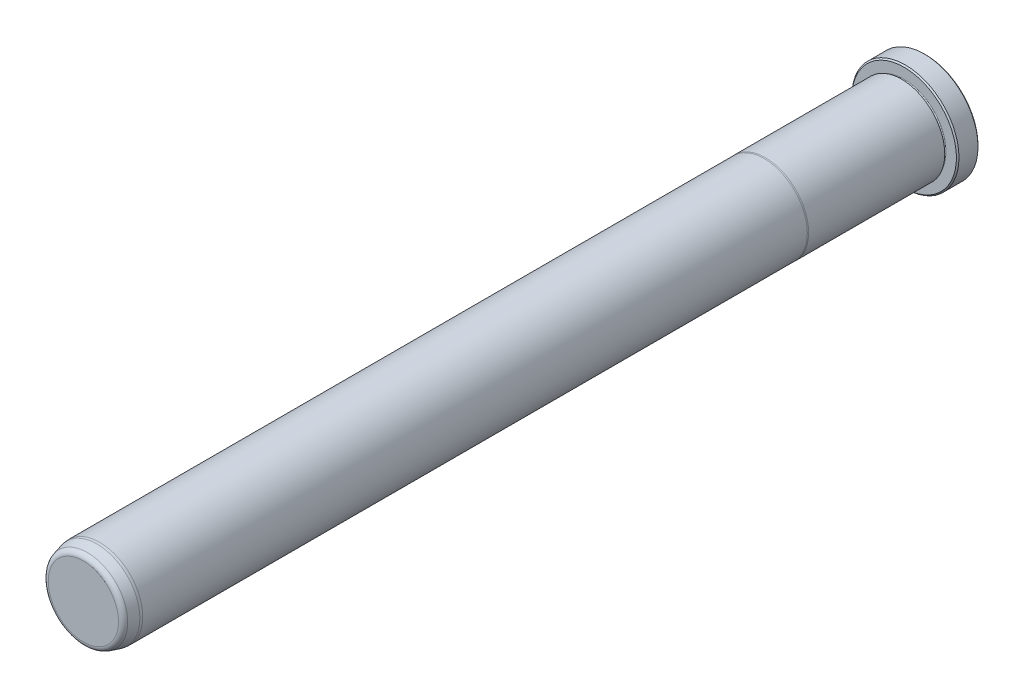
ISO-10303-21;
HEADER;
FILE_DESCRIPTION(('STEP AP214'),'2;1');
FILE_NAME('part.step','',(''),(''),'','','');
FILE_SCHEMA(('AUTOMOTIVE_DESIGN { 1 0 10303 214 1 1 1 1 }'));
ENDSEC;
DATA;
#1=APPLICATION_CONTEXT('core data for automotive mechanical design processes');
#2=APPLICATION_PROTOCOL_DEFINITION('international standard','automotive_design',2000,#1);
#3=PRODUCT_CONTEXT('',#1,'mechanical');
#4=PRODUCT('Part','Part','',(#3));
#5=PRODUCT_RELATED_PRODUCT_CATEGORY('part','',(#4));
#6=PRODUCT_DEFINITION_FORMATION('','',#4);
#7=PRODUCT_DEFINITION_CONTEXT('part definition',#1,'design');
#8=PRODUCT_DEFINITION('design','',#6,#7);
#9=PRODUCT_DEFINITION_SHAPE('','',#8);
#10=(LENGTH_UNIT() NAMED_UNIT(*) SI_UNIT(.MILLI.,.METRE.));
#11=(NAMED_UNIT(*) PLANE_ANGLE_UNIT() SI_UNIT($,.RADIAN.));
#12=(NAMED_UNIT(*) SI_UNIT($,.STERADIAN.) SOLID_ANGLE_UNIT());
#13=UNCERTAINTY_MEASURE_WITH_UNIT(LENGTH_MEASURE(1.E-05),#10,'distance_accuracy_value','');
#14=(GEOMETRIC_REPRESENTATION_CONTEXT(3) GLOBAL_UNCERTAINTY_ASSIGNED_CONTEXT((#13)) GLOBAL_UNIT_ASSIGNED_CONTEXT((#10,
#11,#12)) REPRESENTATION_CONTEXT('',''));
#15=CARTESIAN_POINT('',(0.,0.,0.));
#16=DIRECTION('',(0.,0.,1.));
#17=DIRECTION('',(1.,0.,0.));
#18=AXIS2_PLACEMENT_3D('',#15,#16,#17);
#19=CARTESIAN_POINT('',(0.,0.,0.));
#20=DIRECTION('',(0.,0.,1.));
#21=DIRECTION('',(1.,0.,0.));
#22=AXIS2_PLACEMENT_3D('',#19,#20,#21);
#23=PLANE('',#22);
#24=CARTESIAN_POINT('',(0.,0.,0.));
#25=DIRECTION('',(0.,0.,1.));
#26=DIRECTION('',(1.,0.,0.));
#27=AXIS2_PLACEMENT_3D('',#24,#25,#26);
#28=CIRCLE('',#27,15.367);
#29=CARTESIAN_POINT('',(15.367,0.,0.));
#30=VERTEX_POINT('',#29);
#31=EDGE_CURVE('E37',#30,#30,#28,.F.);
#32=ORIENTED_EDGE('',*,*,#31,.T.);
#33=EDGE_LOOP('',(#32));
#34=FACE_BOUND('',#33,.T.);
#35=ADVANCED_FACE('F30',(#34),#23,.F.);
#36=CARTESIAN_POINT('',(0.,0.,0.));
#37=DIRECTION('',(0.,0.,1.));
#38=DIRECTION('',(1.,0.,0.));
#39=AXIS2_PLACEMENT_3D('',#36,#37,#38);
#40=CYLINDRICAL_SURFACE('',#39,15.748);
#41=CARTESIAN_POINT('',(0.,0.,0.381000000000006));
#42=DIRECTION('',(0.,0.,1.));
#43=DIRECTION('',(1.,0.,0.));
#44=AXIS2_PLACEMENT_3D('',#41,#42,#43);
#45=CIRCLE('',#44,15.748);
#46=CARTESIAN_POINT('',(15.748,0.,0.381000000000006));
#47=VERTEX_POINT('',#46);
#48=EDGE_CURVE('E41',#47,#47,#45,.T.);
#49=ORIENTED_EDGE('',*,*,#48,.T.);
#50=EDGE_LOOP('',(#49));
#51=FACE_BOUND('',#50,.T.);
#52=CARTESIAN_POINT('',(0.,0.,5.96900000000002));
#53=DIRECTION('',(0.,0.,-1.));
#54=DIRECTION('',(-1.,0.,0.));
#55=AXIS2_PLACEMENT_3D('',#52,#53,#54);
#56=CIRCLE('',#55,15.748);
#57=CARTESIAN_POINT('',(-15.748,0.,5.96900000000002));
#58=VERTEX_POINT('',#57);
#59=EDGE_CURVE('E45',#58,#58,#56,.T.);
#60=ORIENTED_EDGE('',*,*,#59,.T.);
#61=EDGE_LOOP('',(#60));
#62=FACE_BOUND('',#61,.T.);
#63=ADVANCED_FACE('F118',(#51,#62),#40,.T.);
#64=CARTESIAN_POINT('',(0.,15.748,6.35));
#65=DIRECTION('',(0.,0.,-1.));
#66=DIRECTION('',(-1.,0.,0.));
#67=AXIS2_PLACEMENT_3D('',#64,#65,#66);
#68=PLANE('',#67);
#69=CARTESIAN_POINT('',(0.,0.,6.35));
#70=DIRECTION('',(0.,0.,-1.));
#71=DIRECTION('',(-1.,0.,0.));
#72=AXIS2_PLACEMENT_3D('',#69,#70,#71);
#73=CIRCLE('',#72,15.367);
#74=CARTESIAN_POINT('',(-15.367,0.,6.35));
#75=VERTEX_POINT('',#74);
#76=EDGE_CURVE('E10',#75,#75,#73,.F.);
#77=ORIENTED_EDGE('',*,*,#76,.T.);
#78=EDGE_LOOP('',(#77));
#79=FACE_BOUND('',#78,.T.);
#80=CARTESIAN_POINT('',(0.,0.,6.35));
#81=DIRECTION('',(0.,0.,1.));
#82=DIRECTION('',(1.,0.,0.));
#83=AXIS2_PLACEMENT_3D('',#80,#81,#82);
#84=CIRCLE('',#83,12.3063);
#85=CARTESIAN_POINT('',(12.3063,0.,6.35));
#86=VERTEX_POINT('',#85);
#87=EDGE_CURVE('E56',#86,#86,#84,.T.);
#88=ORIENTED_EDGE('',*,*,#87,.F.);
#89=EDGE_LOOP('',(#88));
#90=FACE_BOUND('',#89,.T.);
#91=ADVANCED_FACE('F113',(#79,#90),#68,.F.);
#92=CARTESIAN_POINT('',(0.,0.,6.731));
#93=DIRECTION('',(0.,0.,1.));
#94=DIRECTION('',(1.,0.,0.));
#95=AXIS2_PLACEMENT_3D('',#92,#93,#94);
#96=TOROIDAL_SURFACE('',#95,12.3063,0.381);
#97=CARTESIAN_POINT('',(0.,0.,7.112));
#98=DIRECTION('',(0.,0.,1.));
#99=DIRECTION('',(1.,0.,0.));
#100=AXIS2_PLACEMENT_3D('',#97,#98,#99);
#101=CIRCLE('',#100,12.3063);
#102=CARTESIAN_POINT('',(12.3063,0.,7.112));
#103=VERTEX_POINT('',#102);
#104=EDGE_CURVE('E59',#103,#103,#101,.T.);
#105=ORIENTED_EDGE('',*,*,#104,.F.);
#106=EDGE_LOOP('',(#105));
#107=FACE_BOUND('',#106,.T.);
#108=ORIENTED_EDGE('',*,*,#87,.T.);
#109=EDGE_LOOP('',(#108));
#110=FACE_BOUND('',#109,.T.);
#111=ADVANCED_FACE('F107',(#107,#110),#96,.F.);
#112=CARTESIAN_POINT('',(0.,12.3063,7.112));
#113=DIRECTION('',(0.,0.,1.));
#114=DIRECTION('',(1.,0.,0.));
#115=AXIS2_PLACEMENT_3D('',#112,#113,#114);
#116=PLANE('',#115);
#117=CARTESIAN_POINT('',(0.,0.,7.112));
#118=DIRECTION('',(0.,0.,1.));
#119=DIRECTION('',(1.,0.,0.));
#120=AXIS2_PLACEMENT_3D('',#117,#118,#119);
#121=CIRCLE('',#120,12.7127);
#122=CARTESIAN_POINT('',(12.7127,0.,7.112));
#123=VERTEX_POINT('',#122);
#124=EDGE_CURVE('E62',#123,#123,#121,.T.);
#125=ORIENTED_EDGE('',*,*,#124,.F.);
#126=EDGE_LOOP('',(#125));
#127=FACE_BOUND('',#126,.T.);
#128=ORIENTED_EDGE('',*,*,#104,.T.);
#129=EDGE_LOOP('',(#128));
#130=FACE_BOUND('',#129,.T.);
#131=ADVANCED_FACE('F101',(#127,#130),#116,.F.);
#132=CARTESIAN_POINT('',(0.,0.,0.));
#133=DIRECTION('',(0.,0.,1.));
#134=DIRECTION('',(1.,0.,0.));
#135=AXIS2_PLACEMENT_3D('',#132,#133,#134);
#136=CYLINDRICAL_SURFACE('',#135,12.7127);
#137=CARTESIAN_POINT('',(0.,0.,47.1347630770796));
#138=DIRECTION('',(0.,0.,1.));
#139=DIRECTION('',(1.,0.,0.));
#140=AXIS2_PLACEMENT_3D('',#137,#138,#139);
#141=CIRCLE('',#140,12.7127);
#142=CARTESIAN_POINT('',(12.7127,0.,47.1347630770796));
#143=VERTEX_POINT('',#142);
#144=EDGE_CURVE('E65',#143,#143,#141,.T.);
#145=ORIENTED_EDGE('',*,*,#144,.F.);
#146=EDGE_LOOP('',(#145));
#147=FACE_BOUND('',#146,.T.);
#148=ORIENTED_EDGE('',*,*,#124,.T.);
#149=EDGE_LOOP('',(#148));
#150=FACE_BOUND('',#149,.T.);
#151=ADVANCED_FACE('F95',(#147,#150),#136,.T.);
#152=CARTESIAN_POINT('',(0.,0.,47.1347630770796));
#153=DIRECTION('',(0.,0.,-1.));
#154=DIRECTION('',(-1.,0.,0.));
#155=AXIS2_PLACEMENT_3D('',#152,#153,#154);
#156=CONICAL_SURFACE('',#155,12.7127,0.0698131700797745);
#157=CARTESIAN_POINT('',(0.,0.,47.498));
#158=DIRECTION('',(0.,0.,1.));
#159=DIRECTION('',(1.,0.,0.));
#160=AXIS2_PLACEMENT_3D('',#157,#158,#159);
#161=CIRCLE('',#160,12.6873);
#162=CARTESIAN_POINT('',(12.6873,0.,47.498));
#163=VERTEX_POINT('',#162);
#164=EDGE_CURVE('E68',#163,#163,#161,.T.);
#165=ORIENTED_EDGE('',*,*,#164,.F.);
#166=EDGE_LOOP('',(#165));
#167=FACE_BOUND('',#166,.T.);
#168=ORIENTED_EDGE('',*,*,#144,.T.);
#169=EDGE_LOOP('',(#168));
#170=FACE_BOUND('',#169,.T.);
#171=ADVANCED_FACE('F89',(#167,#170),#156,.T.);
#172=CARTESIAN_POINT('',(0.,0.,0.));
#173=DIRECTION('',(0.,0.,1.));
#174=DIRECTION('',(1.,0.,0.));
#175=AXIS2_PLACEMENT_3D('',#172,#173,#174);
#176=CYLINDRICAL_SURFACE('',#175,12.6873);
#177=CARTESIAN_POINT('',(0.,0.,242.8875));
#178=DIRECTION('',(0.,0.,1.));
#179=DIRECTION('',(1.,0.,0.));
#180=AXIS2_PLACEMENT_3D('',#177,#178,#179);
#181=CIRCLE('',#180,12.6873);
#182=CARTESIAN_POINT('',(12.6873,0.,242.8875));
#183=VERTEX_POINT('',#182);
#184=EDGE_CURVE('E71',#183,#183,#181,.T.);
#185=ORIENTED_EDGE('',*,*,#184,.F.);
#186=EDGE_LOOP('',(#185));
#187=FACE_BOUND('',#186,.T.);
#188=ORIENTED_EDGE('',*,*,#164,.T.);
#189=EDGE_LOOP('',(#188));
#190=FACE_BOUND('',#189,.T.);
#191=ADVANCED_FACE('F83',(#187,#190),#176,.T.);
#192=CARTESIAN_POINT('',(0.,0.,242.8875));
#193=DIRECTION('',(0.,0.,-1.));
#194=DIRECTION('',(-1.,0.,0.));
#195=AXIS2_PLACEMENT_3D('',#192,#193,#194);
#196=CONICAL_SURFACE('',#195,12.6873,0.0872664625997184);
#197=CARTESIAN_POINT('',(0.,0.,243.6495));
#198=DIRECTION('',(0.,0.,1.));
#199=DIRECTION('',(1.,0.,0.));
#200=AXIS2_PLACEMENT_3D('',#197,#198,#199);
#201=CIRCLE('',#200,12.6206336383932);
#202=CARTESIAN_POINT('',(12.6206336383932,0.,243.6495));
#203=VERTEX_POINT('',#202);
#204=EDGE_CURVE('E74',#203,#203,#201,.T.);
#205=ORIENTED_EDGE('',*,*,#204,.F.);
#206=EDGE_LOOP('',(#205));
#207=FACE_BOUND('',#206,.T.);
#208=ORIENTED_EDGE('',*,*,#184,.T.);
#209=EDGE_LOOP('',(#208));
#210=FACE_BOUND('',#209,.T.);
#211=ADVANCED_FACE('F80',(#207,#210),#196,.T.);
#212=CARTESIAN_POINT('',(0.,0.,243.6495));
#213=DIRECTION('',(0.,0.,-1.));
#214=DIRECTION('',(-1.,0.,0.));
#215=AXIS2_PLACEMENT_3D('',#212,#213,#214);
#216=CONICAL_SURFACE('',#215,12.6206336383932,0.26179938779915);
#217=CARTESIAN_POINT('',(0.,0.,246.4733752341));
#218=DIRECTION('',(0.,0.,1.));
#219=DIRECTION('',(1.,0.,0.));
#220=AXIS2_PLACEMENT_3D('',#217,#218,#219);
#221=CIRCLE('',#220,11.8639785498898);
#222=CARTESIAN_POINT('',(11.8639785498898,0.,246.4733752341));
#223=VERTEX_POINT('',#222);
#224=EDGE_CURVE('E50',#223,#223,#221,.F.);
#225=ORIENTED_EDGE('',*,*,#224,.T.);
#226=EDGE_LOOP('',(#225));
#227=FACE_BOUND('',#226,.T.);
#228=ORIENTED_EDGE('',*,*,#204,.T.);
#229=EDGE_LOOP('',(#228));
#230=FACE_BOUND('',#229,.T.);
#231=ADVANCED_FACE('F78',(#227,#230),#216,.T.);
#232=CARTESIAN_POINT('',(0.,11.5487028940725,247.65));
#233=DIRECTION('',(0.,0.,-1.));
#234=DIRECTION('',(-1.,0.,0.));
#235=AXIS2_PLACEMENT_3D('',#232,#233,#234);
#236=PLANE('',#235);
#237=CARTESIAN_POINT('',(0.,0.,247.65));
#238=DIRECTION('',(0.,0.,-1.));
#239=DIRECTION('',(-1.,0.,0.));
#240=AXIS2_PLACEMENT_3D('',#237,#238,#239);
#241=CIRCLE('',#240,10.3305713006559);
#242=CARTESIAN_POINT('',(-10.3305713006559,0.,247.65));
#243=VERTEX_POINT('',#242);
#244=EDGE_CURVE('E53',#243,#243,#241,.F.);
#245=ORIENTED_EDGE('',*,*,#244,.T.);
#246=EDGE_LOOP('',(#245));
#247=FACE_BOUND('',#246,.T.);
#248=ADVANCED_FACE('F133',(#247),#236,.F.);
#249=CARTESIAN_POINT('',(0.,0.,246.0625));
#250=DIRECTION('',(0.,0.,-1.));
#251=DIRECTION('',(-1.,0.,0.));
#252=AXIS2_PLACEMENT_3D('',#249,#250,#251);
#253=TOROIDAL_SURFACE('',#252,10.3305713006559,1.5875);
#254=ORIENTED_EDGE('',*,*,#224,.F.);
#255=EDGE_LOOP('',(#254));
#256=FACE_BOUND('',#255,.T.);
#257=ORIENTED_EDGE('',*,*,#244,.F.);
#258=EDGE_LOOP('',(#257));
#259=FACE_BOUND('',#258,.T.);
#260=ADVANCED_FACE('F130',(#256,#259),#253,.T.);
#261=CARTESIAN_POINT('',(0.,0.,0.381000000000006));
#262=DIRECTION('',(0.,0.,1.));
#263=DIRECTION('',(1.,0.,0.));
#264=AXIS2_PLACEMENT_3D('',#261,#262,#263);
#265=CONICAL_SURFACE('',#264,15.748,0.785398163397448);
#266=CARTESIAN_POINT('',(15.367,0.,0.));
#267=CARTESIAN_POINT('',(15.37096875,0.,0.00396874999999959));
#268=CARTESIAN_POINT('',(15.3749375,0.,0.00793749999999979));
#269=CARTESIAN_POINT('',(15.382875,0.,0.0158750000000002));
#270=CARTESIAN_POINT('',(15.38684375,0.,0.0198437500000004));
#271=CARTESIAN_POINT('',(15.39478125,0.,0.0277812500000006));
#272=CARTESIAN_POINT('',(15.39875,0.,0.0317500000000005));
#273=CARTESIAN_POINT('',(15.4066875,0.,0.0396875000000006));
#274=CARTESIAN_POINT('',(15.41065625,0.,0.0436562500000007));
#275=CARTESIAN_POINT('',(15.41859375,0.,0.0515937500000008));
#276=CARTESIAN_POINT('',(15.4225625,0.,0.0555625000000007));
#277=CARTESIAN_POINT('',(15.4305,0.,0.0635000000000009));
#278=CARTESIAN_POINT('',(15.43446875,0.,0.0674687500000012));
#279=CARTESIAN_POINT('',(15.44240625,0.,0.0754062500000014));
#280=CARTESIAN_POINT('',(15.446375,0.,0.0793750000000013));
#281=CARTESIAN_POINT('',(15.4543125,0.,0.0873125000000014));
#282=CARTESIAN_POINT('',(15.45828125,0.,0.0912812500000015));
#283=CARTESIAN_POINT('',(15.46621875,0.,0.0992187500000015));
#284=CARTESIAN_POINT('',(15.4701875,0.,0.103187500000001));
#285=CARTESIAN_POINT('',(15.478125,0.,0.111125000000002));
#286=CARTESIAN_POINT('',(15.48209375,0.,0.115093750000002));
#287=CARTESIAN_POINT('',(15.49003125,0.,0.123031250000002));
#288=CARTESIAN_POINT('',(15.494,0.,0.127000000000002));
#289=CARTESIAN_POINT('',(15.5019375,0.,0.134937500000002));
#290=CARTESIAN_POINT('',(15.50590625,0.,0.138906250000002));
#291=CARTESIAN_POINT('',(15.51384375,0.,0.146843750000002));
#292=CARTESIAN_POINT('',(15.5178125,0.,0.150812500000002));
#293=CARTESIAN_POINT('',(15.52575,0.,0.158750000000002));
#294=CARTESIAN_POINT('',(15.52971875,0.,0.162718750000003));
#295=CARTESIAN_POINT('',(15.53765625,0.,0.170656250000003));
#296=CARTESIAN_POINT('',(15.541625,0.,0.174625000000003));
#297=CARTESIAN_POINT('',(15.5495625,0.,0.182562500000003));
#298=CARTESIAN_POINT('',(15.55353125,0.,0.186531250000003));
#299=CARTESIAN_POINT('',(15.56146875,0.,0.194468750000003));
#300=CARTESIAN_POINT('',(15.5654375,0.,0.198437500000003));
#301=CARTESIAN_POINT('',(15.573375,0.,0.206375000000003));
#302=CARTESIAN_POINT('',(15.57734375,0.,0.210343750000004));
#303=CARTESIAN_POINT('',(15.58528125,0.,0.218281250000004));
#304=CARTESIAN_POINT('',(15.58925,0.,0.222250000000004));
#305=CARTESIAN_POINT('',(15.5971875,0.,0.230187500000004));
#306=CARTESIAN_POINT('',(15.60115625,0.,0.234156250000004));
#307=CARTESIAN_POINT('',(15.60909375,0.,0.242093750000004));
#308=CARTESIAN_POINT('',(15.6130625,0.,0.246062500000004));
#309=CARTESIAN_POINT('',(15.621,0.,0.254000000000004));
#310=CARTESIAN_POINT('',(15.62496875,0.,0.257968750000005));
#311=CARTESIAN_POINT('',(15.63290625,0.,0.265906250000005));
#312=CARTESIAN_POINT('',(15.636875,0.,0.269875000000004));
#313=CARTESIAN_POINT('',(15.6448125,0.,0.277812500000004));
#314=CARTESIAN_POINT('',(15.64878125,0.,0.281781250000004));
#315=CARTESIAN_POINT('',(15.65671875,0.,0.289718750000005));
#316=CARTESIAN_POINT('',(15.6606875,0.,0.293687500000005));
#317=CARTESIAN_POINT('',(15.668625,0.,0.301625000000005));
#318=CARTESIAN_POINT('',(15.67259375,0.,0.305593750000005));
#319=CARTESIAN_POINT('',(15.68053125,0.,0.313531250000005));
#320=CARTESIAN_POINT('',(15.6845,0.,0.317500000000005));
#321=CARTESIAN_POINT('',(15.6924375,0.,0.325437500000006));
#322=CARTESIAN_POINT('',(15.69640625,0.,0.329406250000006));
#323=CARTESIAN_POINT('',(15.70434375,0.,0.337343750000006));
#324=CARTESIAN_POINT('',(15.7083125,0.,0.341312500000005));
#325=CARTESIAN_POINT('',(15.71625,0.,0.349250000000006));
#326=CARTESIAN_POINT('',(15.72021875,0.,0.353218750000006));
#327=CARTESIAN_POINT('',(15.72815625,0.,0.361156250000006));
#328=CARTESIAN_POINT('',(15.732125,0.,0.365125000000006));
#329=CARTESIAN_POINT('',(15.7400625,0.,0.373062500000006));
#330=CARTESIAN_POINT('',(15.74403125,0.,0.377031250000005));
#331=CARTESIAN_POINT('',(15.748,0.,0.381000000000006));
#332=B_SPLINE_CURVE_WITH_KNOTS('',3,(#266,#267,#268,#269,#270,#271,#272,#273,#274,#275,#276,
#277,#278,#279,#280,#281,#282,#283,#284,#285,#286,#287,#288,#289,#290,#291,#292,#293,#294,#295,
#296,#297,#298,#299,#300,#301,#302,#303,#304,#305,#306,#307,#308,#309,#310,#311,#312,#313,#314,
#315,#316,#317,#318,#319,#320,#321,#322,#323,#324,#325,#326,#327,#328,#329,#330,#331),
.UNSPECIFIED.,.F.,.F.,(4,2,2,2,2,2,2,2,2,2,2,2,2,2,2,2,2,2,2,2,2,2,2,2,2,2,2,2,2,2,2,2,4),(0.,
0.0168379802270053,0.0336759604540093,0.0505139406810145,0.0673519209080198,0.084189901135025,
0.101027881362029,0.117865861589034,0.13470384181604,0.151541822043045,0.168379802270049,
0.185217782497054,0.202055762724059,0.218893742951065,0.235731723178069,0.252569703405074,
0.269407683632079,0.286245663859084,0.303083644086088,0.319921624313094,0.336759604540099,
0.353597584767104,0.370435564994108,0.387273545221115,0.404111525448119,0.420949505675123,
0.437787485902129,0.454625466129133,0.471463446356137,0.488301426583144,0.505139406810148,
0.521977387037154,0.538815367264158),.UNSPECIFIED.);
#333=EDGE_CURVE('BSEAM132',#30,#47,#332,.T.);
#334=ORIENTED_EDGE('',*,*,#31,.F.);
#335=ORIENTED_EDGE('',*,*,#48,.F.);
#336=ORIENTED_EDGE('',*,*,#333,.T.);
#337=ORIENTED_EDGE('',*,*,#333,.F.);
#338=EDGE_LOOP('',(#334,#336,#335,#337));
#339=FACE_BOUND('',#338,.T.);
#340=ADVANCED_FACE('F132',(#339),#265,.T.);
#341=CARTESIAN_POINT('',(0.,0.,6.35));
#342=DIRECTION('',(0.,0.,-1.));
#343=DIRECTION('',(-1.,0.,0.));
#344=AXIS2_PLACEMENT_3D('',#341,#342,#343);
#345=CONICAL_SURFACE('',#344,15.367,0.785398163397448);
#346=ORIENTED_EDGE('',*,*,#59,.F.);
#347=EDGE_LOOP('',(#346));
#348=FACE_BOUND('',#347,.T.);
#349=ORIENTED_EDGE('',*,*,#76,.F.);
#350=EDGE_LOOP('',(#349));
#351=FACE_BOUND('',#350,.T.);
#352=ADVANCED_FACE('F32',(#348,#351),#345,.T.);
#353=CLOSED_SHELL('',(#35,#63,#91,#111,#131,#151,#171,#191,#211,#231,#248,#260,#340,#352));
#354=MANIFOLD_SOLID_BREP('B2',#353);
#355=ADVANCED_BREP_SHAPE_REPRESENTATION('',(#18,#354),#14);
#356=SHAPE_DEFINITION_REPRESENTATION(#9,#355);
ENDSEC;
END-ISO-10303-21;
